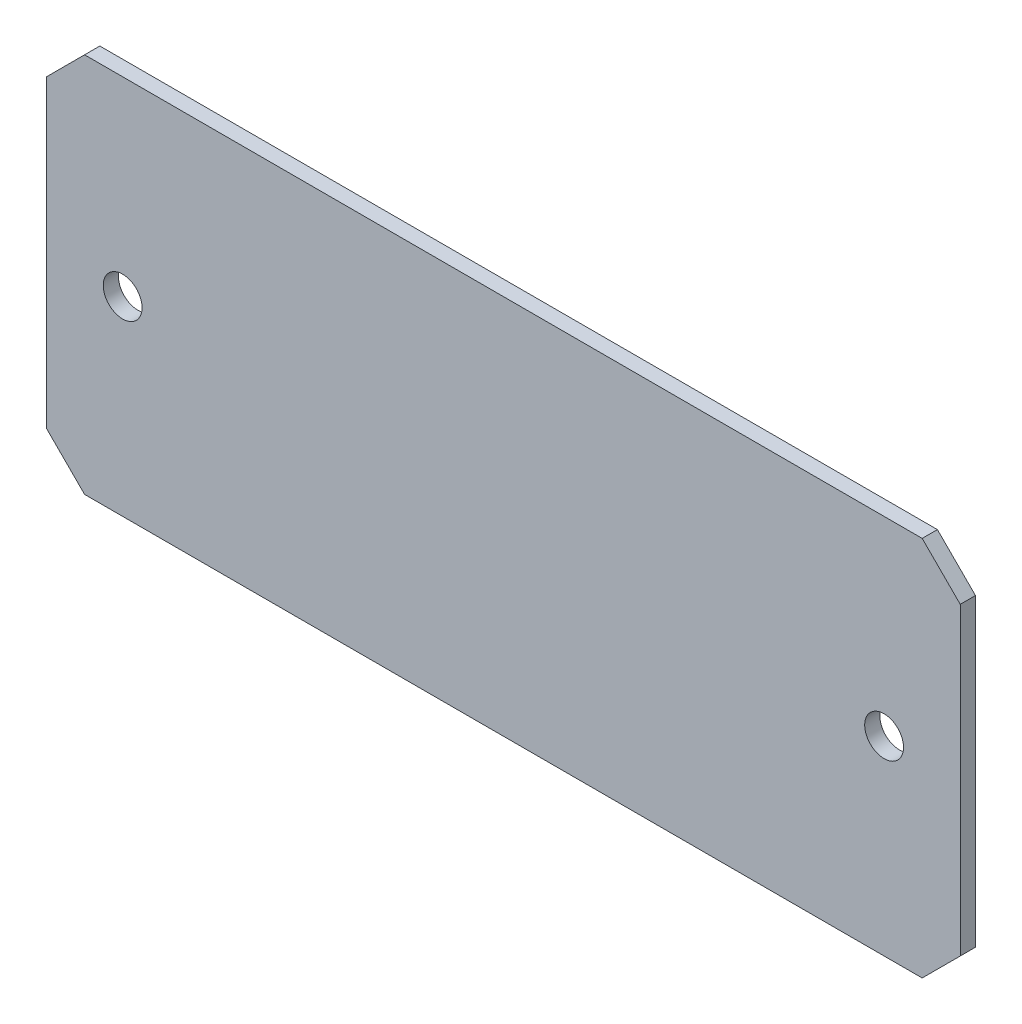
ISO-10303-21;
HEADER;
FILE_DESCRIPTION(('STEP AP214'),'2;1');
FILE_NAME('part.step','',(''),(''),'','','');
FILE_SCHEMA(('AUTOMOTIVE_DESIGN { 1 0 10303 214 1 1 1 1 }'));
ENDSEC;
DATA;
#1=APPLICATION_CONTEXT('core data for automotive mechanical design processes');
#2=APPLICATION_PROTOCOL_DEFINITION('international standard','automotive_design',2000,#1);
#3=PRODUCT_CONTEXT('',#1,'mechanical');
#4=PRODUCT('Part','Part','',(#3));
#5=PRODUCT_RELATED_PRODUCT_CATEGORY('part','',(#4));
#6=PRODUCT_DEFINITION_FORMATION('','',#4);
#7=PRODUCT_DEFINITION_CONTEXT('part definition',#1,'design');
#8=PRODUCT_DEFINITION('design','',#6,#7);
#9=PRODUCT_DEFINITION_SHAPE('','',#8);
#10=(LENGTH_UNIT() NAMED_UNIT(*) SI_UNIT(.MILLI.,.METRE.));
#11=(NAMED_UNIT(*) PLANE_ANGLE_UNIT() SI_UNIT($,.RADIAN.));
#12=(NAMED_UNIT(*) SI_UNIT($,.STERADIAN.) SOLID_ANGLE_UNIT());
#13=UNCERTAINTY_MEASURE_WITH_UNIT(LENGTH_MEASURE(1.E-05),#10,'distance_accuracy_value','');
#14=(GEOMETRIC_REPRESENTATION_CONTEXT(3) GLOBAL_UNCERTAINTY_ASSIGNED_CONTEXT((#13)) GLOBAL_UNIT_ASSIGNED_CONTEXT((#10,
#11,#12)) REPRESENTATION_CONTEXT('',''));
#15=CARTESIAN_POINT('',(0.,0.,0.));
#16=DIRECTION('',(0.,0.,1.));
#17=DIRECTION('',(1.,0.,0.));
#18=AXIS2_PLACEMENT_3D('',#15,#16,#17);
#19=CARTESIAN_POINT('',(0.,0.,4.));
#20=DIRECTION('',(1.,0.,0.));
#21=DIRECTION('',(0.,0.,-1.));
#22=AXIS2_PLACEMENT_3D('',#19,#20,#21);
#23=PLANE('',#22);
#24=DIRECTION('',(0.,-1.,0.));
#25=VECTOR('',#24,1.);
#26=CARTESIAN_POINT('',(0.,0.,0.));
#27=LINE('',#26,#25);
#28=CARTESIAN_POINT('',(0.,90.0000000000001,0.));
#29=VERTEX_POINT('',#28);
#30=CARTESIAN_POINT('',(0.,10.0000000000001,0.));
#31=VERTEX_POINT('',#30);
#32=EDGE_CURVE('E132',#29,#31,#27,.T.);
#33=ORIENTED_EDGE('',*,*,#32,.T.);
#34=DIRECTION('',(0.,0.,1.));
#35=VECTOR('',#34,1.);
#36=CARTESIAN_POINT('',(0.,10.0000000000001,4.));
#37=LINE('',#36,#35);
#38=CARTESIAN_POINT('',(0.,10.0000000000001,4.));
#39=VERTEX_POINT('',#38);
#40=EDGE_CURVE('E11',#31,#39,#37,.T.);
#41=ORIENTED_EDGE('',*,*,#40,.T.);
#42=DIRECTION('',(0.,-1.,0.));
#43=VECTOR('',#42,1.);
#44=CARTESIAN_POINT('',(0.,0.,4.));
#45=LINE('',#44,#43);
#46=CARTESIAN_POINT('',(0.,90.0000000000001,4.));
#47=VERTEX_POINT('',#46);
#48=EDGE_CURVE('E130',#47,#39,#45,.T.);
#49=ORIENTED_EDGE('',*,*,#48,.F.);
#50=DIRECTION('',(0.,0.,-1.));
#51=VECTOR('',#50,1.);
#52=CARTESIAN_POINT('',(0.,90.0000000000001,4.));
#53=LINE('',#52,#51);
#54=EDGE_CURVE('E43',#47,#29,#53,.T.);
#55=ORIENTED_EDGE('',*,*,#54,.T.);
#56=EDGE_LOOP('',(#33,#41,#49,#55));
#57=FACE_BOUND('',#56,.T.);
#58=ADVANCED_FACE('F34',(#57),#23,.F.);
#59=CARTESIAN_POINT('',(0.,0.,4.));
#60=DIRECTION('',(0.,1.,0.));
#61=DIRECTION('',(0.,0.,1.));
#62=AXIS2_PLACEMENT_3D('',#59,#60,#61);
#63=PLANE('',#62);
#64=DIRECTION('',(1.,0.,0.));
#65=VECTOR('',#64,1.);
#66=CARTESIAN_POINT('',(0.,0.,0.));
#67=LINE('',#66,#65);
#68=CARTESIAN_POINT('',(10.,0.,0.));
#69=VERTEX_POINT('',#68);
#70=CARTESIAN_POINT('',(230.,0.,0.));
#71=VERTEX_POINT('',#70);
#72=EDGE_CURVE('E128',#69,#71,#67,.T.);
#73=ORIENTED_EDGE('',*,*,#72,.T.);
#74=DIRECTION('',(0.,0.,1.));
#75=VECTOR('',#74,1.);
#76=CARTESIAN_POINT('',(230.,0.,4.));
#77=LINE('',#76,#75);
#78=CARTESIAN_POINT('',(230.,0.,4.));
#79=VERTEX_POINT('',#78);
#80=EDGE_CURVE('E107',#71,#79,#77,.T.);
#81=ORIENTED_EDGE('',*,*,#80,.T.);
#82=DIRECTION('',(1.,0.,0.));
#83=VECTOR('',#82,1.);
#84=CARTESIAN_POINT('',(0.,0.,4.));
#85=LINE('',#84,#83);
#86=CARTESIAN_POINT('',(10.,0.,4.));
#87=VERTEX_POINT('',#86);
#88=EDGE_CURVE('E173',#87,#79,#85,.T.);
#89=ORIENTED_EDGE('',*,*,#88,.F.);
#90=DIRECTION('',(0.,0.,-1.));
#91=VECTOR('',#90,1.);
#92=CARTESIAN_POINT('',(10.,0.,4.));
#93=LINE('',#92,#91);
#94=EDGE_CURVE('E112',#87,#69,#93,.T.);
#95=ORIENTED_EDGE('',*,*,#94,.T.);
#96=EDGE_LOOP('',(#73,#81,#89,#95));
#97=FACE_BOUND('',#96,.T.);
#98=ADVANCED_FACE('F192',(#97),#63,.F.);
#99=CARTESIAN_POINT('',(240.,0.,4.));
#100=DIRECTION('',(-1.,0.,0.));
#101=DIRECTION('',(0.,0.,1.));
#102=AXIS2_PLACEMENT_3D('',#99,#100,#101);
#103=PLANE('',#102);
#104=DIRECTION('',(0.,1.,0.));
#105=VECTOR('',#104,1.);
#106=CARTESIAN_POINT('',(240.,0.,4.));
#107=LINE('',#106,#105);
#108=CARTESIAN_POINT('',(240.,10.,4.));
#109=VERTEX_POINT('',#108);
#110=CARTESIAN_POINT('',(240.,89.9999999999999,4.));
#111=VERTEX_POINT('',#110);
#112=EDGE_CURVE('E121',#109,#111,#107,.T.);
#113=ORIENTED_EDGE('',*,*,#112,.F.);
#114=DIRECTION('',(0.,0.,-1.));
#115=VECTOR('',#114,1.);
#116=CARTESIAN_POINT('',(240.,10.,4.));
#117=LINE('',#116,#115);
#118=CARTESIAN_POINT('',(240.,10.0000000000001,0.));
#119=VERTEX_POINT('',#118);
#120=EDGE_CURVE('E106',#109,#119,#117,.T.);
#121=ORIENTED_EDGE('',*,*,#120,.T.);
#122=DIRECTION('',(0.,1.,0.));
#123=VECTOR('',#122,1.);
#124=CARTESIAN_POINT('',(240.,0.,0.));
#125=LINE('',#124,#123);
#126=CARTESIAN_POINT('',(240.,89.9999999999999,0.));
#127=VERTEX_POINT('',#126);
#128=EDGE_CURVE('E119',#119,#127,#125,.T.);
#129=ORIENTED_EDGE('',*,*,#128,.T.);
#130=DIRECTION('',(0.,0.,1.));
#131=VECTOR('',#130,1.);
#132=CARTESIAN_POINT('',(240.,89.9999999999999,4.));
#133=LINE('',#132,#131);
#134=EDGE_CURVE('E123',#127,#111,#133,.T.);
#135=ORIENTED_EDGE('',*,*,#134,.T.);
#136=EDGE_LOOP('',(#113,#121,#129,#135));
#137=FACE_BOUND('',#136,.T.);
#138=ADVANCED_FACE('F118',(#137),#103,.F.);
#139=CARTESIAN_POINT('',(0.,100.,4.));
#140=DIRECTION('',(0.,-1.,0.));
#141=DIRECTION('',(0.,0.,-1.));
#142=AXIS2_PLACEMENT_3D('',#139,#140,#141);
#143=PLANE('',#142);
#144=DIRECTION('',(-1.,0.,0.));
#145=VECTOR('',#144,1.);
#146=CARTESIAN_POINT('',(0.,100.,4.));
#147=LINE('',#146,#145);
#148=CARTESIAN_POINT('',(230.,100.,4.));
#149=VERTEX_POINT('',#148);
#150=CARTESIAN_POINT('',(10.,100.,4.));
#151=VERTEX_POINT('',#150);
#152=EDGE_CURVE('E136',#149,#151,#147,.T.);
#153=ORIENTED_EDGE('',*,*,#152,.F.);
#154=DIRECTION('',(0.,0.,-1.));
#155=VECTOR('',#154,1.);
#156=CARTESIAN_POINT('',(230.,100.,4.));
#157=LINE('',#156,#155);
#158=CARTESIAN_POINT('',(230.,100.,0.));
#159=VERTEX_POINT('',#158);
#160=EDGE_CURVE('E153',#149,#159,#157,.T.);
#161=ORIENTED_EDGE('',*,*,#160,.T.);
#162=DIRECTION('',(-1.,0.,0.));
#163=VECTOR('',#162,1.);
#164=CARTESIAN_POINT('',(0.,100.,0.));
#165=LINE('',#164,#163);
#166=CARTESIAN_POINT('',(10.,100.,0.));
#167=VERTEX_POINT('',#166);
#168=EDGE_CURVE('E127',#159,#167,#165,.T.);
#169=ORIENTED_EDGE('',*,*,#168,.T.);
#170=DIRECTION('',(0.,0.,1.));
#171=VECTOR('',#170,1.);
#172=CARTESIAN_POINT('',(10.,100.,4.));
#173=LINE('',#172,#171);
#174=EDGE_CURVE('E51',#167,#151,#173,.T.);
#175=ORIENTED_EDGE('',*,*,#174,.T.);
#176=EDGE_LOOP('',(#153,#161,#169,#175));
#177=FACE_BOUND('',#176,.T.);
#178=ADVANCED_FACE('F195',(#177),#143,.F.);
#179=CARTESIAN_POINT('',(0.,100.,4.));
#180=DIRECTION('',(0.,0.,-1.));
#181=DIRECTION('',(-1.,0.,0.));
#182=AXIS2_PLACEMENT_3D('',#179,#180,#181);
#183=PLANE('',#182);
#184=CARTESIAN_POINT('',(20.,50.,4.));
#185=DIRECTION('',(0.,0.,1.));
#186=DIRECTION('',(1.,0.,0.));
#187=AXIS2_PLACEMENT_3D('',#184,#185,#186);
#188=CIRCLE('',#187,5.09999999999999);
#189=CARTESIAN_POINT('',(25.0999999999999,50.,4.));
#190=VERTEX_POINT('',#189);
#191=EDGE_CURVE('E168',#190,#190,#188,.T.);
#192=ORIENTED_EDGE('',*,*,#191,.F.);
#193=EDGE_LOOP('',(#192));
#194=FACE_BOUND('',#193,.T.);
#195=CARTESIAN_POINT('',(220.,50.,4.));
#196=DIRECTION('',(0.,0.,1.));
#197=DIRECTION('',(1.,0.,0.));
#198=AXIS2_PLACEMENT_3D('',#195,#196,#197);
#199=CIRCLE('',#198,5.09999999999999);
#200=CARTESIAN_POINT('',(225.1,50.,4.));
#201=VERTEX_POINT('',#200);
#202=EDGE_CURVE('E159',#201,#201,#199,.T.);
#203=ORIENTED_EDGE('',*,*,#202,.F.);
#204=EDGE_LOOP('',(#203));
#205=FACE_BOUND('',#204,.T.);
#206=ORIENTED_EDGE('',*,*,#88,.T.);
#207=DIRECTION('',(-0.707106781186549,-0.707106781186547,0.));
#208=VECTOR('',#207,1.);
#209=CARTESIAN_POINT('',(240.,10.,4.));
#210=LINE('',#209,#208);
#211=EDGE_CURVE('E150',#79,#109,#210,.F.);
#212=ORIENTED_EDGE('',*,*,#211,.T.);
#213=ORIENTED_EDGE('',*,*,#112,.T.);
#214=DIRECTION('',(0.707106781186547,-0.707106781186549,0.));
#215=VECTOR('',#214,1.);
#216=CARTESIAN_POINT('',(230.,100.,4.));
#217=LINE('',#216,#215);
#218=EDGE_CURVE('E58',#111,#149,#217,.F.);
#219=ORIENTED_EDGE('',*,*,#218,.T.);
#220=ORIENTED_EDGE('',*,*,#152,.T.);
#221=DIRECTION('',(0.707106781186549,0.707106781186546,0.));
#222=VECTOR('',#221,1.);
#223=CARTESIAN_POINT('',(0.,90.0000000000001,4.));
#224=LINE('',#223,#222);
#225=EDGE_CURVE('E145',#151,#47,#224,.F.);
#226=ORIENTED_EDGE('',*,*,#225,.T.);
#227=ORIENTED_EDGE('',*,*,#48,.T.);
#228=DIRECTION('',(-0.707106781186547,0.707106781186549,0.));
#229=VECTOR('',#228,1.);
#230=CARTESIAN_POINT('',(10.,0.,4.));
#231=LINE('',#230,#229);
#232=EDGE_CURVE('E147',#39,#87,#231,.F.);
#233=ORIENTED_EDGE('',*,*,#232,.T.);
#234=EDGE_LOOP('',(#206,#212,#213,#219,#220,#226,#227,#233));
#235=FACE_BOUND('',#234,.T.);
#236=ADVANCED_FACE('F178',(#194,#205,#235),#183,.F.);
#237=CARTESIAN_POINT('',(0.,100.,0.));
#238=DIRECTION('',(0.,0.,-1.));
#239=DIRECTION('',(-1.,0.,0.));
#240=AXIS2_PLACEMENT_3D('',#237,#238,#239);
#241=PLANE('',#240);
#242=CARTESIAN_POINT('',(20.,50.,0.));
#243=DIRECTION('',(0.,0.,-1.));
#244=DIRECTION('',(-1.,0.,0.));
#245=AXIS2_PLACEMENT_3D('',#242,#243,#244);
#246=CIRCLE('',#245,5.09999999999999);
#247=CARTESIAN_POINT('',(14.9,50.,0.));
#248=VERTEX_POINT('',#247);
#249=EDGE_CURVE('E38',#248,#248,#246,.T.);
#250=ORIENTED_EDGE('',*,*,#249,.F.);
#251=EDGE_LOOP('',(#250));
#252=FACE_BOUND('',#251,.T.);
#253=CARTESIAN_POINT('',(220.,50.,0.));
#254=DIRECTION('',(0.,0.,-1.));
#255=DIRECTION('',(-1.,0.,0.));
#256=AXIS2_PLACEMENT_3D('',#253,#254,#255);
#257=CIRCLE('',#256,5.09999999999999);
#258=CARTESIAN_POINT('',(214.9,50.,0.));
#259=VERTEX_POINT('',#258);
#260=EDGE_CURVE('E157',#259,#259,#257,.T.);
#261=ORIENTED_EDGE('',*,*,#260,.F.);
#262=EDGE_LOOP('',(#261));
#263=FACE_BOUND('',#262,.T.);
#264=ORIENTED_EDGE('',*,*,#128,.F.);
#265=DIRECTION('',(0.707106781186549,0.707106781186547,0.));
#266=VECTOR('',#265,1.);
#267=CARTESIAN_POINT('',(165.,-65.0000000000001,0.));
#268=LINE('',#267,#266);
#269=EDGE_CURVE('E102',#119,#71,#268,.F.);
#270=ORIENTED_EDGE('',*,*,#269,.T.);
#271=ORIENTED_EDGE('',*,*,#72,.F.);
#272=DIRECTION('',(0.707106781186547,-0.707106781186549,0.));
#273=VECTOR('',#272,1.);
#274=CARTESIAN_POINT('',(-45.,55.0000000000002,0.));
#275=LINE('',#274,#273);
#276=EDGE_CURVE('E139',#69,#31,#275,.F.);
#277=ORIENTED_EDGE('',*,*,#276,.T.);
#278=ORIENTED_EDGE('',*,*,#32,.F.);
#279=DIRECTION('',(-0.707106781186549,-0.707106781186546,0.));
#280=VECTOR('',#279,1.);
#281=CARTESIAN_POINT('',(4.99999999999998,95.,0.));
#282=LINE('',#281,#280);
#283=EDGE_CURVE('E122',#29,#167,#282,.F.);
#284=ORIENTED_EDGE('',*,*,#283,.T.);
#285=ORIENTED_EDGE('',*,*,#168,.F.);
#286=DIRECTION('',(-0.707106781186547,0.707106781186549,0.));
#287=VECTOR('',#286,1.);
#288=CARTESIAN_POINT('',(115.,215.,0.));
#289=LINE('',#288,#287);
#290=EDGE_CURVE('E113',#159,#127,#289,.F.);
#291=ORIENTED_EDGE('',*,*,#290,.T.);
#292=EDGE_LOOP('',(#264,#270,#271,#277,#278,#284,#285,#291));
#293=FACE_BOUND('',#292,.T.);
#294=ADVANCED_FACE('F125',(#252,#263,#293),#241,.T.);
#295=CARTESIAN_POINT('',(240.,10.,4.));
#296=DIRECTION('',(-0.707106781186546,0.707106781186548,0.));
#297=DIRECTION('',(-0.707106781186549,-0.707106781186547,0.));
#298=AXIS2_PLACEMENT_3D('',#295,#296,#297);
#299=PLANE('',#298);
#300=ORIENTED_EDGE('',*,*,#211,.F.);
#301=ORIENTED_EDGE('',*,*,#80,.F.);
#302=ORIENTED_EDGE('',*,*,#269,.F.);
#303=ORIENTED_EDGE('',*,*,#120,.F.);
#304=EDGE_LOOP('',(#300,#301,#302,#303));
#305=FACE_BOUND('',#304,.T.);
#306=ADVANCED_FACE('F105',(#305),#299,.F.);
#307=CARTESIAN_POINT('',(230.,100.,4.));
#308=DIRECTION('',(-0.707106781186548,-0.707106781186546,0.));
#309=DIRECTION('',(0.707106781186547,-0.707106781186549,0.));
#310=AXIS2_PLACEMENT_3D('',#307,#308,#309);
#311=PLANE('',#310);
#312=ORIENTED_EDGE('',*,*,#218,.F.);
#313=ORIENTED_EDGE('',*,*,#134,.F.);
#314=ORIENTED_EDGE('',*,*,#290,.F.);
#315=ORIENTED_EDGE('',*,*,#160,.F.);
#316=EDGE_LOOP('',(#312,#313,#314,#315));
#317=FACE_BOUND('',#316,.T.);
#318=ADVANCED_FACE('F194',(#317),#311,.F.);
#319=CARTESIAN_POINT('',(10.,0.,4.));
#320=DIRECTION('',(0.707106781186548,0.707106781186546,0.));
#321=DIRECTION('',(-0.707106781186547,0.707106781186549,0.));
#322=AXIS2_PLACEMENT_3D('',#319,#320,#321);
#323=PLANE('',#322);
#324=ORIENTED_EDGE('',*,*,#232,.F.);
#325=ORIENTED_EDGE('',*,*,#40,.F.);
#326=ORIENTED_EDGE('',*,*,#276,.F.);
#327=ORIENTED_EDGE('',*,*,#94,.F.);
#328=EDGE_LOOP('',(#324,#325,#326,#327));
#329=FACE_BOUND('',#328,.T.);
#330=ADVANCED_FACE('F189',(#329),#323,.F.);
#331=CARTESIAN_POINT('',(0.,90.0000000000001,4.));
#332=DIRECTION('',(0.707106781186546,-0.707106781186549,0.));
#333=DIRECTION('',(0.707106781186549,0.707106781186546,0.));
#334=AXIS2_PLACEMENT_3D('',#331,#332,#333);
#335=PLANE('',#334);
#336=ORIENTED_EDGE('',*,*,#225,.F.);
#337=ORIENTED_EDGE('',*,*,#174,.F.);
#338=ORIENTED_EDGE('',*,*,#283,.F.);
#339=ORIENTED_EDGE('',*,*,#54,.F.);
#340=EDGE_LOOP('',(#336,#337,#338,#339));
#341=FACE_BOUND('',#340,.T.);
#342=ADVANCED_FACE('F36',(#341),#335,.F.);
#343=CARTESIAN_POINT('',(220.,50.,4.));
#344=DIRECTION('',(0.,0.,1.));
#345=DIRECTION('',(1.,0.,0.));
#346=AXIS2_PLACEMENT_3D('',#343,#344,#345);
#347=CYLINDRICAL_SURFACE('',#346,5.09999999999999);
#348=ORIENTED_EDGE('',*,*,#260,.T.);
#349=EDGE_LOOP('',(#348));
#350=FACE_BOUND('',#349,.T.);
#351=ORIENTED_EDGE('',*,*,#202,.T.);
#352=EDGE_LOOP('',(#351));
#353=FACE_BOUND('',#352,.T.);
#354=ADVANCED_FACE('F220',(#350,#353),#347,.F.);
#355=CARTESIAN_POINT('',(20.,50.,4.));
#356=DIRECTION('',(0.,0.,1.));
#357=DIRECTION('',(1.,0.,0.));
#358=AXIS2_PLACEMENT_3D('',#355,#356,#357);
#359=CYLINDRICAL_SURFACE('',#358,5.09999999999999);
#360=ORIENTED_EDGE('',*,*,#249,.T.);
#361=EDGE_LOOP('',(#360));
#362=FACE_BOUND('',#361,.T.);
#363=ORIENTED_EDGE('',*,*,#191,.T.);
#364=EDGE_LOOP('',(#363));
#365=FACE_BOUND('',#364,.T.);
#366=ADVANCED_FACE('F224',(#362,#365),#359,.F.);
#367=CLOSED_SHELL('',(#58,#98,#138,#178,#236,#294,#306,#318,#330,#342,#354,#366));
#368=MANIFOLD_SOLID_BREP('B2',#367);
#369=ADVANCED_BREP_SHAPE_REPRESENTATION('',(#18,#368),#14);
#370=SHAPE_DEFINITION_REPRESENTATION(#9,#369);
ENDSEC;
END-ISO-10303-21;
